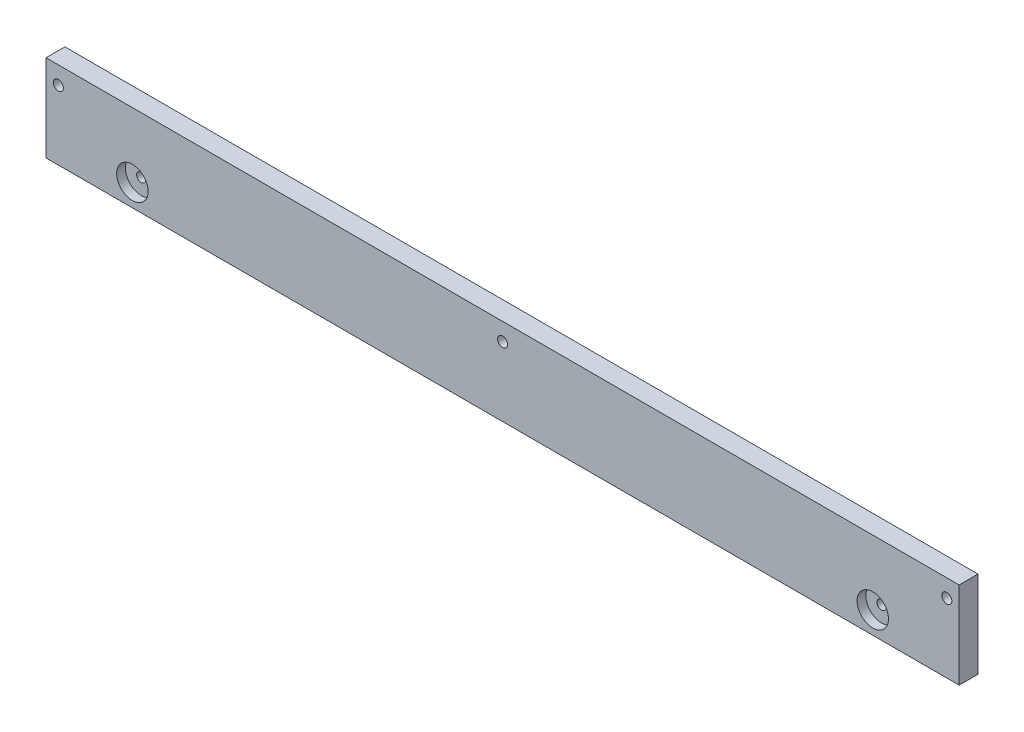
from build123d import *

# Parameters (mm, degrees)
ESQUISSE5_W             = 290.597320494
ESQUISSE5_H             = 27.625
ESQUISSE5_R             = 1.6
EXTRUSION1_DEPTH        = 6
ESQUISSE4_R             = 5
ENL_V_MAT_EXTRU_2_DEPTH = 2.8
ESQUISSE6_R             = 1.45
ENL_V_MAT_EXTRU_3_DEPTH = 2.5


with BuildPart() as part:
    # Esquisse5 → Extrusion1 (new body)
    with BuildSketch(Plane.XY):
        with Locations((141.37166943, 13.8125)):
            Rectangle(ESQUISSE5_W, ESQUISSE5_H)
        with Locations((282.74333886, 22)):
            Circle(ESQUISSE5_R, mode=Mode.SUBTRACT)
        with Locations((0, 22)):
            Circle(ESQUISSE5_R, mode=Mode.SUBTRACT)
        with Locations((141.37315521, 22)):
            Circle(ESQUISSE5_R, mode=Mode.SUBTRACT)
    extrude(amount=EXTRUSION1_DEPTH)

    # Esquisse4 → Enl_v. mat.-Extru.2 (cut)
    with BuildSketch(Plane.XY.offset(6)):
        with Locations((23.561944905, 7)):
            Circle(ESQUISSE4_R)
        with Locations((259.181393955, 7)):
            Circle(ESQUISSE4_R)
    extrude(amount=-ENL_V_MAT_EXTRU_2_DEPTH, mode=Mode.SUBTRACT)

    # Esquisse6 → Enl_v. mat.-Extru.3 (cut)
    with BuildSketch(Plane.XY.offset(3.2)):
        with Locations((23.561944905, 7)):
            Circle(ESQUISSE6_R)
        with Locations((259.181393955, 7)):
            Circle(ESQUISSE6_R)
    extrude(amount=-ENL_V_MAT_EXTRU_3_DEPTH, mode=Mode.SUBTRACT)


solid = part.part
